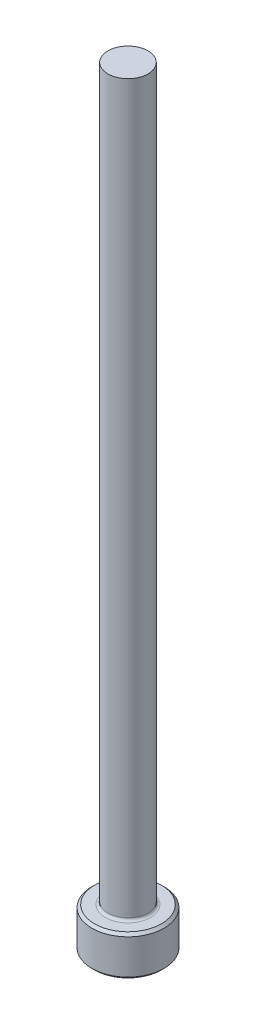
from build123d import *

# Parameters (mm, degrees)
CHAMFER1_SIZE = 0.254
FILLET1_R     = 0.254


with BuildPart() as part:
    # Sketch1 → Revolve1 (revolve)
    with BuildSketch(Plane.XY, mode=Mode.PRIVATE) as revolve1_sk:
        Polygon((0, 0), (-3.5687, 0), (-3.5687, 3.9624), (-1.98374, 3.9624), (-1.98374, 76.2), (0, 76.2), align=None)
    revolve(revolve1_sk.sketch.rotate(Axis((0, 259.958771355, 0), (0, -1, 0)), 270), axis=Axis((0, 259.958771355, 0), (0, -1, 0)))

    # Chamfer1
    chamfer1_edges = [part.edges().sort_by_distance(p)[0] for p in [
        (0, 3.9624, -3.5687),
        (0, 0, -3.5687),
    ]]
    chamfer(chamfer1_edges, length=CHAMFER1_SIZE)

    # Fillet1
    fillet1_edges = [part.edges().sort_by_distance(p)[0] for p in [
        (0, 3.9624, -1.98374),
    ]]
    fillet(fillet1_edges, radius=FILLET1_R)


solid = part.part
